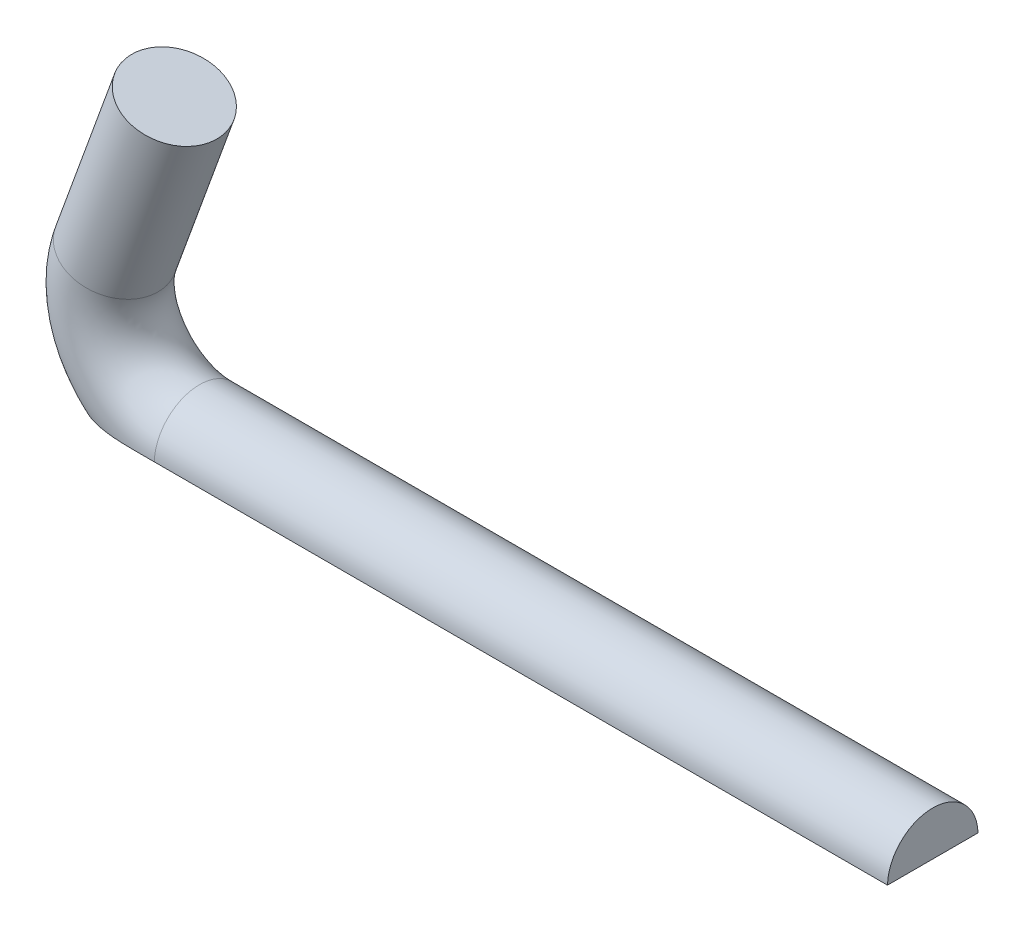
from build123d import *

# Parameters (mm, degrees)
SKETCH2_R               = 1.1684
CUT_EXTRUDE1_DEPTH      = 24.712188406
CUT_EXTRUDE1_DEPTH_BACK = 24.712188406
SKETCH3_W               = 21.844
SKETCH3_H               = 1.524


with BuildPart() as part:
    # Sweep1: sweep along a path in Sketch1
    with BuildLine(Plane.XY) as sweep1_path:
        Line((0, 0), (-18.923978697, 0))
        ThreePointArc((-18.923978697, 0), (-20.817366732, 0.985635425), (-21.095984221, 3.101945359))
        Line((-21.095984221, 3.101945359), (-19.57536995, 7.279798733))
    # Sketch2 → Sweep1 (sweep)
    with BuildSketch(Plane(origin=(0, 0, 0), x_dir=(0, 0, -1), z_dir=(1, 0, 0))):
        Circle(SKETCH2_R)
    sweep(path=sweep1_path.line)

    # Sketch3 → Cut-Extrude1 (cut, two sides: drawn at the far end of the back side and taken through both)
    with BuildSketch(Plane.XY.offset(-CUT_EXTRUDE1_DEPTH_BACK)):
        with Locations((-10.922, -0.7366)):
            Rectangle(SKETCH3_W, SKETCH3_H)
    extrude(amount=CUT_EXTRUDE1_DEPTH + CUT_EXTRUDE1_DEPTH_BACK, mode=Mode.SUBTRACT)


solid = part.part
